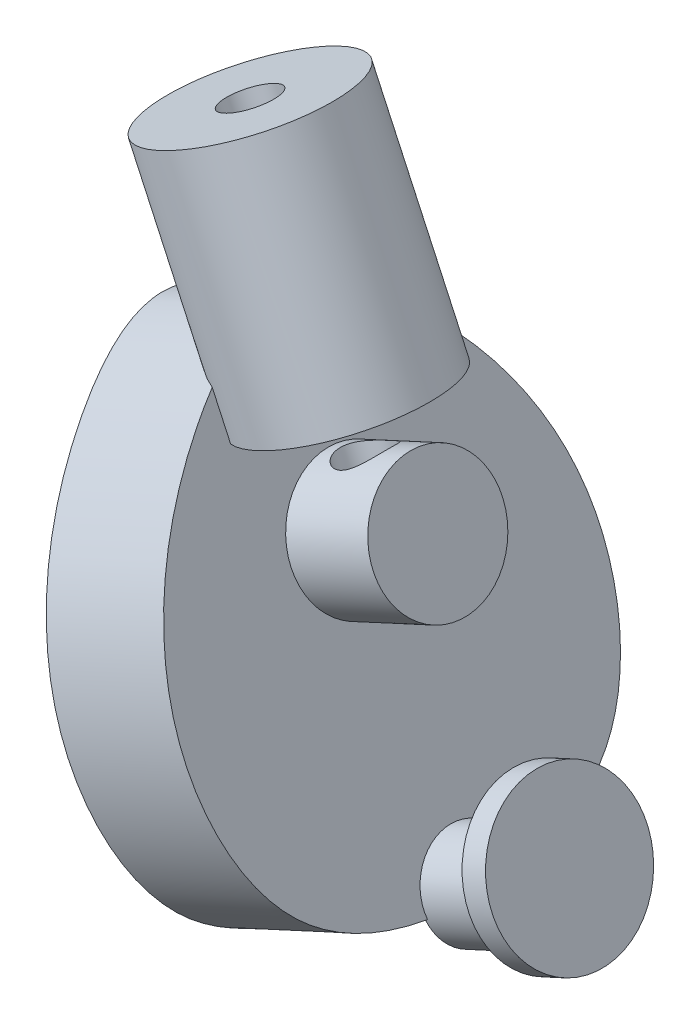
from build123d import *

# Parameters (mm, degrees)
PLACA_DEPTH                    = 2.5
BUJE_CABLE_PROFILE_R           = 3.5
TORNILLO_PISACABLES_PROFILE_R  = 2.5
PASO_CABLE_PRINCIPAL_PROFILE_R = 1
PESTANA_PROFILE_R              = 1.8
LABIO_PROFILE_R                = 3


with BuildPart() as part:
    # Sk_Placa → Placa (new, symmetric)
    with BuildSketch(Plane(origin=(504.880130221, 233.021598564, 0), x_dir=(0, 0, 1), z_dir=(-0.9079593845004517, -0.41905817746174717, 0))):
        with BuildLine():
            add(Edge.make_bspline(
                [(0, 225.213202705), (1.404685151, 225.213202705), (5.902868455, 222.284529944), (9.072068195, 215.843391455), (6.4788047, 208.217156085), (0, 206.670955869), (-6.4788047, 208.217156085), (-9.072068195, 215.843391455), (-5.902868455, 222.284529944), (-1.404685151, 225.213202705), (0, 225.213202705)],
                knots=[0, 0, 0, 0, 0.085901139, 0.275078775, 0.378517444, 0.5, 0.621482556, 0.724921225, 0.914098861, 1, 1, 1, 1], degree=3))
        make_face()
    extrude(amount=PLACA_DEPTH, both=True)

    # Buje_cable: sweep along a curve in space
    with BuildLine() as buje_cable_path:
        Line((411.620184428, 444.63002849, 0), (415.391708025, 436.458394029, 0))
    # Buje_cable profile (on start of the path) → Buje_cable (sweep)
    with BuildSketch(Plane(origin=(411.620184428, 444.63002849, 0), x_dir=(-0.9079593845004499, -0.4190581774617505, 0), z_dir=(0.41905817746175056, -0.9079593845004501, 0))):
        Circle(BUJE_CABLE_PROFILE_R)
    sweep(path=buje_cable_path.line)

    # Tornillo_pisacables: sweep along a curve in space
    with BuildLine() as tornillo_pisacables_path:
        Line((409.804265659, 429.474091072, 0), (418.883859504, 433.664672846, 0))
    # Tornillo_pisacables profile (on start of the path) → Tornillo_pisacables (sweep)
    with BuildSketch(Plane(origin=(409.804265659, 429.474091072, 0), x_dir=(-0.4190581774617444, 0.9079593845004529, 0), z_dir=(0.9079593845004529, 0.4190581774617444, 0))):
        Circle(TORNILLO_PISACABLES_PROFILE_R)
    sweep(path=tornillo_pisacables_path.line)

    # Paso_cable_principal: sweep along a curve in space
    with BuildLine() as paso_cable_principal_path:
        Line((410.782068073, 446.445947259, 0), (418.325115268, 430.102678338, 0))
    # Paso_cable_principal profile (on start of the path) → Paso_cable_principal (sweep, cut)
    with BuildSketch(Plane(origin=(410.782068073, 446.445947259, 0), x_dir=(-0.9079593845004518, -0.41905817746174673, 0), z_dir=(0.41905817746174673, -0.9079593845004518, 0))):
        Circle(PASO_CABLE_PRINCIPAL_PROFILE_R)
    sweep(path=paso_cable_principal_path.line, mode=Mode.SUBTRACT)

    # Pestana: sweep along a curve in space
    with BuildLine() as pestana_path:
        Line((420.057222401, 422.531693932, 0), (423.325876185, 424.04030337, 0))
    # Pestana profile (on start of the path) → Pestana (sweep)
    with BuildSketch(Plane(origin=(420.057222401, 422.531693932, 0), x_dir=(-0.4190581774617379, 0.9079593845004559, 0), z_dir=(0.9079593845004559, 0.4190581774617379, 0))):
        Circle(PESTANA_PROFILE_R)
    sweep(path=pestana_path.line)

    # Labio: sweep along a curve in space
    with BuildLine() as labio_path:
        Line((423.074441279, 424.585079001, 0), (423.982400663, 425.004137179, 0))
    # Labio profile (on start of the path) → Labio (sweep)
    with BuildSketch(Plane(origin=(423.074441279, 424.585079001, 0), x_dir=(-0.4190581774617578, 0.9079593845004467, 0), z_dir=(0.9079593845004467, 0.4190581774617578, 0))):
        Circle(LABIO_PROFILE_R)
    sweep(path=labio_path.line)


solid = part.part
